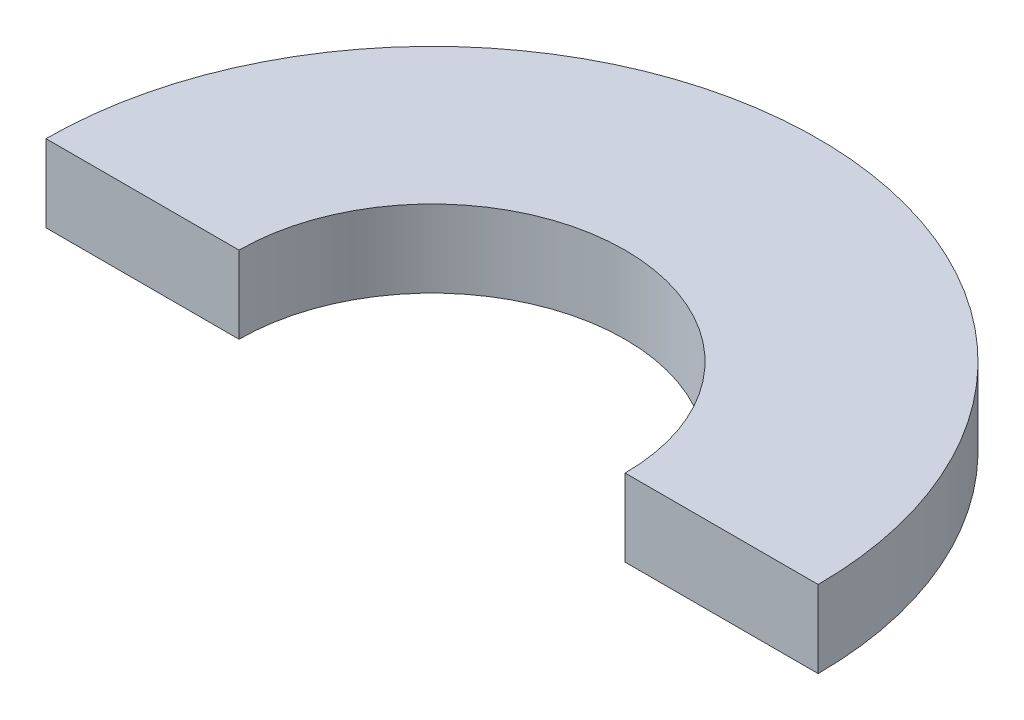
ISO-10303-21;
HEADER;
FILE_DESCRIPTION(('STEP AP214'),'2;1');
FILE_NAME('part.step','',(''),(''),'','','');
FILE_SCHEMA(('AUTOMOTIVE_DESIGN { 1 0 10303 214 1 1 1 1 }'));
ENDSEC;
DATA;
#1=APPLICATION_CONTEXT('core data for automotive mechanical design processes');
#2=APPLICATION_PROTOCOL_DEFINITION('international standard','automotive_design',2000,#1);
#3=PRODUCT_CONTEXT('',#1,'mechanical');
#4=PRODUCT('Part','Part','',(#3));
#5=PRODUCT_RELATED_PRODUCT_CATEGORY('part','',(#4));
#6=PRODUCT_DEFINITION_FORMATION('','',#4);
#7=PRODUCT_DEFINITION_CONTEXT('part definition',#1,'design');
#8=PRODUCT_DEFINITION('design','',#6,#7);
#9=PRODUCT_DEFINITION_SHAPE('','',#8);
#10=(LENGTH_UNIT() NAMED_UNIT(*) SI_UNIT(.MILLI.,.METRE.));
#11=(NAMED_UNIT(*) PLANE_ANGLE_UNIT() SI_UNIT($,.RADIAN.));
#12=(NAMED_UNIT(*) SI_UNIT($,.STERADIAN.) SOLID_ANGLE_UNIT());
#13=UNCERTAINTY_MEASURE_WITH_UNIT(LENGTH_MEASURE(1.E-05),#10,'distance_accuracy_value','');
#14=(GEOMETRIC_REPRESENTATION_CONTEXT(3) GLOBAL_UNCERTAINTY_ASSIGNED_CONTEXT((#13)) GLOBAL_UNIT_ASSIGNED_CONTEXT((#10,
#11,#12)) REPRESENTATION_CONTEXT('',''));
#15=CARTESIAN_POINT('',(0.,0.,0.));
#16=DIRECTION('',(0.,0.,1.));
#17=DIRECTION('',(1.,0.,0.));
#18=AXIS2_PLACEMENT_3D('',#15,#16,#17);
#19=CARTESIAN_POINT('',(0.,1.2,0.));
#20=DIRECTION('',(0.,1.,0.));
#21=DIRECTION('',(0.,0.,1.));
#22=AXIS2_PLACEMENT_3D('',#19,#20,#21);
#23=PLANE('',#22);
#24=CARTESIAN_POINT('',(0.,1.2,0.));
#25=DIRECTION('',(0.,1.,0.));
#26=DIRECTION('',(0.,0.,1.));
#27=AXIS2_PLACEMENT_3D('',#24,#25,#26);
#28=CIRCLE('',#27,6.);
#29=CARTESIAN_POINT('',(6.,1.2,0.));
#30=VERTEX_POINT('',#29);
#31=CARTESIAN_POINT('',(-6.,1.20000000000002,0.));
#32=VERTEX_POINT('',#31);
#33=EDGE_CURVE('E87',#30,#32,#28,.T.);
#34=ORIENTED_EDGE('',*,*,#33,.T.);
#35=DIRECTION('',(1.,0.,0.));
#36=VECTOR('',#35,1.);
#37=CARTESIAN_POINT('',(0.,1.2,0.));
#38=LINE('',#37,#36);
#39=CARTESIAN_POINT('',(-3.,1.20000000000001,0.));
#40=VERTEX_POINT('',#39);
#41=EDGE_CURVE('E102',#32,#40,#38,.T.);
#42=ORIENTED_EDGE('',*,*,#41,.T.);
#43=CARTESIAN_POINT('',(0.,1.2,0.));
#44=DIRECTION('',(0.,1.,0.));
#45=DIRECTION('',(0.,0.,1.));
#46=AXIS2_PLACEMENT_3D('',#43,#44,#45);
#47=CIRCLE('',#46,3.);
#48=CARTESIAN_POINT('',(3.,1.2,0.));
#49=VERTEX_POINT('',#48);
#50=EDGE_CURVE('E90',#49,#40,#47,.T.);
#51=ORIENTED_EDGE('',*,*,#50,.F.);
#52=EDGE_CURVE('E55',#49,#30,#38,.T.);
#53=ORIENTED_EDGE('',*,*,#52,.T.);
#54=EDGE_LOOP('',(#34,#42,#51,#53));
#55=FACE_BOUND('',#54,.T.);
#56=ADVANCED_FACE('F33',(#55),#23,.T.);
#57=CARTESIAN_POINT('',(0.,0.,0.));
#58=DIRECTION('',(0.,1.,0.));
#59=DIRECTION('',(0.,0.,1.));
#60=AXIS2_PLACEMENT_3D('',#57,#58,#59);
#61=PLANE('',#60);
#62=DIRECTION('',(-1.,0.,0.));
#63=VECTOR('',#62,1.);
#64=CARTESIAN_POINT('',(0.,0.,0.));
#65=LINE('',#64,#63);
#66=CARTESIAN_POINT('',(-3.,0.,0.));
#67=VERTEX_POINT('',#66);
#68=CARTESIAN_POINT('',(-6.,0.,0.));
#69=VERTEX_POINT('',#68);
#70=EDGE_CURVE('E48',#67,#69,#65,.T.);
#71=ORIENTED_EDGE('',*,*,#70,.T.);
#72=CARTESIAN_POINT('',(0.,0.,0.));
#73=DIRECTION('',(0.,1.,0.));
#74=DIRECTION('',(0.,0.,1.));
#75=AXIS2_PLACEMENT_3D('',#72,#73,#74);
#76=CIRCLE('',#75,6.);
#77=CARTESIAN_POINT('',(6.,0.,0.));
#78=VERTEX_POINT('',#77);
#79=EDGE_CURVE('E85',#78,#69,#76,.T.);
#80=ORIENTED_EDGE('',*,*,#79,.F.);
#81=CARTESIAN_POINT('',(3.,0.,0.));
#82=VERTEX_POINT('',#81);
#83=EDGE_CURVE('E71',#78,#82,#65,.T.);
#84=ORIENTED_EDGE('',*,*,#83,.T.);
#85=CARTESIAN_POINT('',(0.,0.,0.));
#86=DIRECTION('',(0.,1.,0.));
#87=DIRECTION('',(0.,0.,1.));
#88=AXIS2_PLACEMENT_3D('',#85,#86,#87);
#89=CIRCLE('',#88,3.);
#90=EDGE_CURVE('E94',#82,#67,#89,.T.);
#91=ORIENTED_EDGE('',*,*,#90,.T.);
#92=EDGE_LOOP('',(#71,#80,#84,#91));
#93=FACE_BOUND('',#92,.T.);
#94=ADVANCED_FACE('F89',(#93),#61,.F.);
#95=CARTESIAN_POINT('',(0.,1.2,0.));
#96=DIRECTION('',(0.,-1.,0.));
#97=DIRECTION('',(0.,0.,-1.));
#98=AXIS2_PLACEMENT_3D('',#95,#96,#97);
#99=CYLINDRICAL_SURFACE('',#98,6.);
#100=DIRECTION('',(0.,1.,0.));
#101=VECTOR('',#100,1.);
#102=CARTESIAN_POINT('',(-6.,0.,0.));
#103=LINE('',#102,#101);
#104=EDGE_CURVE('E79',#69,#32,#103,.T.);
#105=ORIENTED_EDGE('',*,*,#104,.T.);
#106=ORIENTED_EDGE('',*,*,#33,.F.);
#107=DIRECTION('',(0.,1.,0.));
#108=VECTOR('',#107,1.);
#109=CARTESIAN_POINT('',(6.,0.,0.));
#110=LINE('',#109,#108);
#111=EDGE_CURVE('E74',#78,#30,#110,.T.);
#112=ORIENTED_EDGE('',*,*,#111,.F.);
#113=ORIENTED_EDGE('',*,*,#79,.T.);
#114=EDGE_LOOP('',(#105,#106,#112,#113));
#115=FACE_BOUND('',#114,.T.);
#116=ADVANCED_FACE('F35',(#115),#99,.T.);
#117=CARTESIAN_POINT('',(0.,1.2,0.));
#118=DIRECTION('',(0.,-1.,0.));
#119=DIRECTION('',(0.,0.,-1.));
#120=AXIS2_PLACEMENT_3D('',#117,#118,#119);
#121=CYLINDRICAL_SURFACE('',#120,3.);
#122=ORIENTED_EDGE('',*,*,#50,.T.);
#123=DIRECTION('',(0.,-1.,0.));
#124=VECTOR('',#123,1.);
#125=CARTESIAN_POINT('',(-3.,1.2,0.));
#126=LINE('',#125,#124);
#127=EDGE_CURVE('E11',#40,#67,#126,.T.);
#128=ORIENTED_EDGE('',*,*,#127,.T.);
#129=ORIENTED_EDGE('',*,*,#90,.F.);
#130=DIRECTION('',(0.,-1.,0.));
#131=VECTOR('',#130,1.);
#132=CARTESIAN_POINT('',(3.,1.2,0.));
#133=LINE('',#132,#131);
#134=EDGE_CURVE('E41',#82,#49,#133,.F.);
#135=ORIENTED_EDGE('',*,*,#134,.T.);
#136=EDGE_LOOP('',(#122,#128,#129,#135));
#137=FACE_BOUND('',#136,.T.);
#138=ADVANCED_FACE('F99',(#137),#121,.F.);
#139=CARTESIAN_POINT('',(0.,1.2,0.));
#140=DIRECTION('',(0.,0.,1.));
#141=DIRECTION('',(1.,0.,0.));
#142=AXIS2_PLACEMENT_3D('',#139,#140,#141);
#143=PLANE('',#142);
#144=ORIENTED_EDGE('',*,*,#83,.F.);
#145=ORIENTED_EDGE('',*,*,#111,.T.);
#146=ORIENTED_EDGE('',*,*,#52,.F.);
#147=ORIENTED_EDGE('',*,*,#134,.F.);
#148=EDGE_LOOP('',(#144,#145,#146,#147));
#149=FACE_BOUND('',#148,.T.);
#150=ADVANCED_FACE('F73',(#149),#143,.T.);
#151=ORIENTED_EDGE('',*,*,#41,.F.);
#152=ORIENTED_EDGE('',*,*,#104,.F.);
#153=ORIENTED_EDGE('',*,*,#70,.F.);
#154=ORIENTED_EDGE('',*,*,#127,.F.);
#155=EDGE_LOOP('',(#151,#152,#153,#154));
#156=FACE_BOUND('',#155,.T.);
#157=ADVANCED_FACE('F105',(#156),#143,.T.);
#158=CLOSED_SHELL('',(#56,#94,#116,#138,#150,#157));
#159=MANIFOLD_SOLID_BREP('B2',#158);
#160=ADVANCED_BREP_SHAPE_REPRESENTATION('',(#18,#159),#14);
#161=SHAPE_DEFINITION_REPRESENTATION(#9,#160);
ENDSEC;
END-ISO-10303-21;
